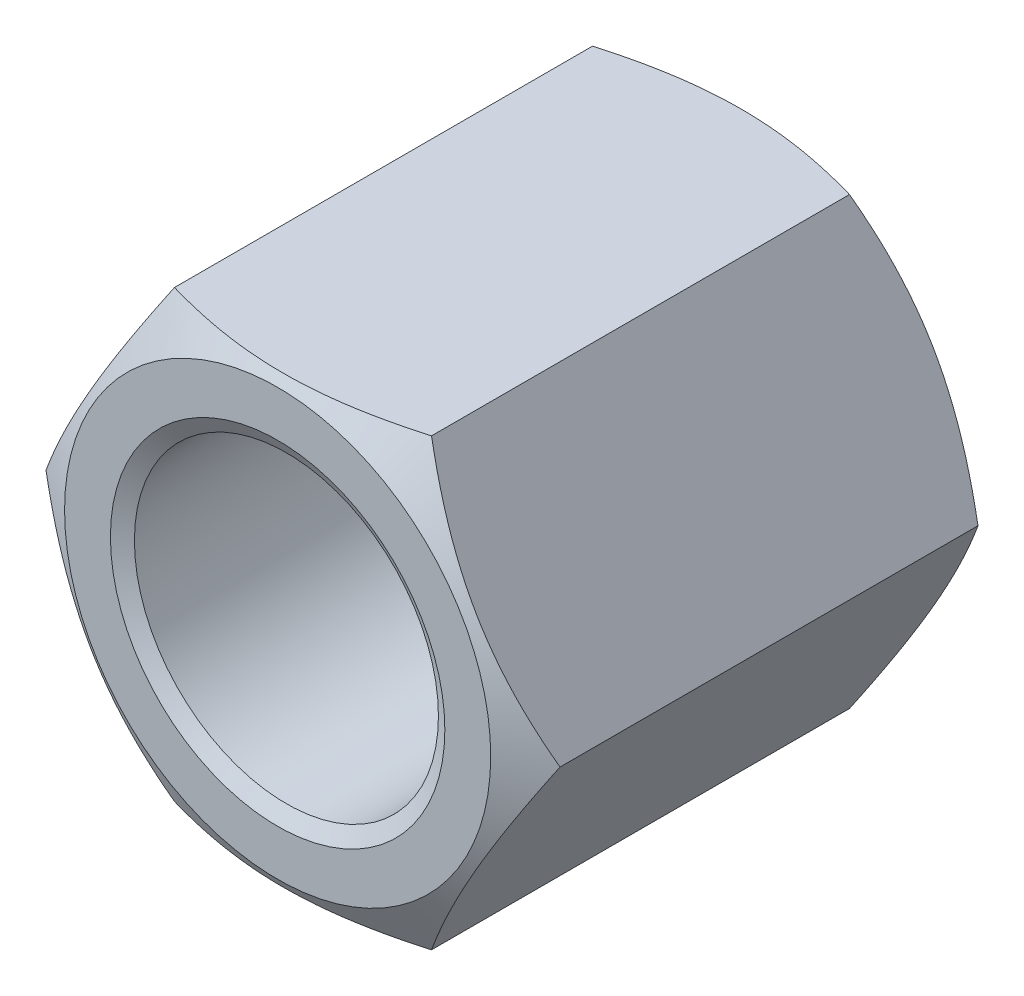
from build123d import *
from OCP.BRepFilletAPI import BRepFilletAPI_MakeChamfer

# Parameters (mm, degrees)
SKETCH1_R        = 6
BASENUT_DEPTH    = 18.5
ENDCHAMFER_SIZE  = 0.6
ENDCHAMFER_SIZE2 = 0.346410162


with BuildPart() as part:
    # Sketch1 → BaseNut (new body)
    with BuildSketch(Plane.XY):
        Polygon((5.072022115, -8.785), (10.14404423, 0), (5.072022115, 8.785), (-5.072022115, 8.785), (-10.14404423, 0), (-5.072022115, -8.785), align=None)
        Circle(SKETCH1_R, mode=Mode.SUBTRACT)
    extrude(amount=-BASENUT_DEPTH)

    # Sketch2 → Double-Chamfer (revolve, cut)
    with BuildSketch(Plane(origin=(0, 0, 0), x_dir=(1, 0, 0), z_dir=(0, 1, 0))):
        Polygon((-10.14404423, 18.5), (-8.41, 18.5), (-10.14404423, 17.498849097), align=None)
        Polygon((-10.14404423, 1.001150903), (-10.14404423, 0), (-8.41, 0), align=None)
    revolve(axis=Axis((0, 0, -3.375940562), (0, 0, 1)), mode=Mode.SUBTRACT)

    # EndChamfer: one chamfer whose edges measure the first distance from different faces: ONE call of the kernel's chamfer builder (chamfer() names one face for all edges)
    endchamfer_edges_1 = [part.edges().sort_by_distance(p)[0] for p in [
        (-6, 0, -18.5),
    ]]
    endchamfer_side_1 = [part.faces().sort_by_distance(p)[0] for p in [
        (-6, 0, -9.25),
    ]]
    endchamfer_edges_2 = [part.edges().sort_by_distance(p)[0] for p in [
        (-6, 0, 0),
    ]]
    endchamfer_side_2 = [part.faces().sort_by_distance(p)[0] for p in [
        (8.172129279, 0, 0),
    ]]
    endchamfer = BRepFilletAPI_MakeChamfer(part.part.solid().wrapped)
    for e in endchamfer_edges_1:
        endchamfer.Add(ENDCHAMFER_SIZE, ENDCHAMFER_SIZE2, e.wrapped, endchamfer_side_1[0].wrapped)  # the first distance lies on this face
    for e in endchamfer_edges_2:
        endchamfer.Add(ENDCHAMFER_SIZE, ENDCHAMFER_SIZE2, e.wrapped, endchamfer_side_2[0].wrapped)  # the first distance lies on this face
    add(Compound.cast(endchamfer.Shape()), mode=Mode.REPLACE)


solid = part.part
